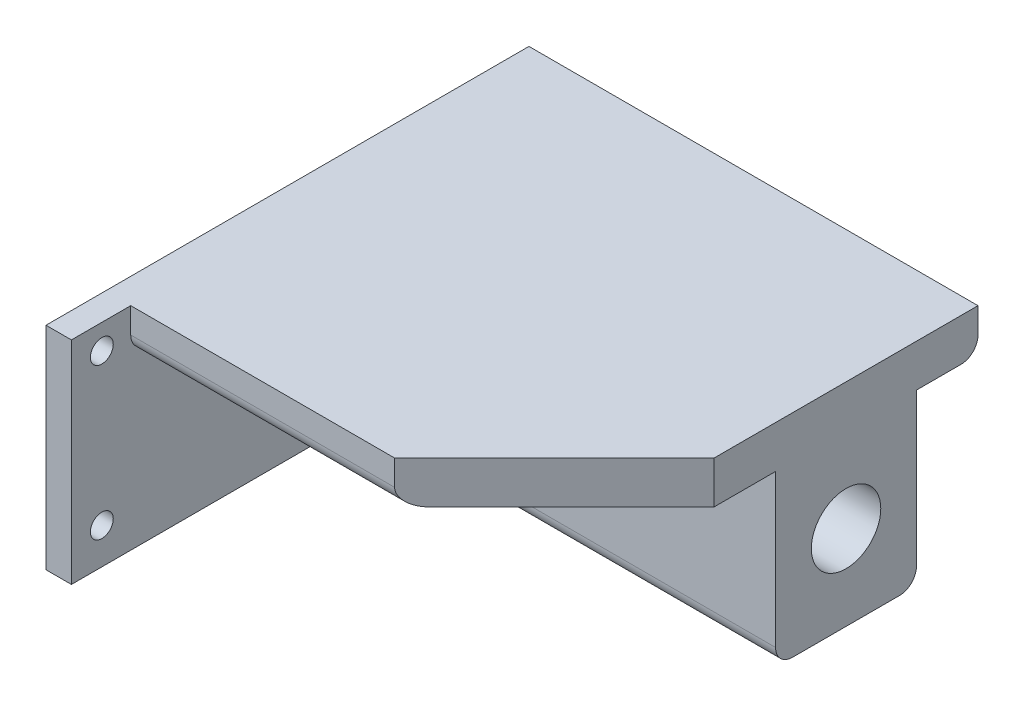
from build123d import *

# Parameters (mm, degrees)
BOSS_EXTRUDE1_DEPTH     = 5
SKETCH2_W               = 50
SKETCH2_H               = 16.625226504
BOSS_EXTRUDE2_DEPTH     = 20
SKETCH3_R               = 4.1
CUT_EXTRUDE1_DEPTH      = 30
FILLET1_R               = 2
SKETCH8_W               = 57
SKETCH8_H               = 25
BOSS_EXTRUDE5_DEPTH     = 3
CUT_EXTRUDE2_DEPTH      = 63.960295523
CUT_EXTRUDE2_DEPTH_BACK = 63.960295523
SKETCH9_R               = 1.35


with BuildPart() as part:
    # Sketch1 → Boss-Extrude1 (new body)
    with BuildSketch(Plane(origin=(0, 0, 0), x_dir=(1, 0, 0), z_dir=(0, 1, 0))):
        Polygon((5.529592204, -25.618994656), (24.381005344, -6.767581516), (24.381005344, 24.381005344), (-25.618994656, 24.381005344), (-25.618994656, -25.618994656), align=None)
    extrude(amount=BOSS_EXTRUDE1_DEPTH)

    # Sketch2 → Boss-Extrude2 (add)
    with BuildSketch(Plane.XZ):
        with Locations((-0.618994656, -8.806711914)):
            Rectangle(SKETCH2_W, SKETCH2_H)
    extrude(amount=BOSS_EXTRUDE2_DEPTH)

    # Sketch3 → Cut-Extrude1 (cut)
    with BuildSketch(Plane(origin=(24.381005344, 0, 0), x_dir=(0, 0, -1), z_dir=(1, 0, 0))):
        with Locations((8.806711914, -10)):
            Circle(SKETCH3_R)
    extrude(amount=-CUT_EXTRUDE1_DEPTH, mode=Mode.SUBTRACT)

    # Fillet1
    fillet1_edges = [part.edges().sort_by_distance(p)[0] for p in [
        (-0.618994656, -20, -0.494098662),
        (-0.618994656, -20, -17.119325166),
        (-10.044701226, 0, 25.618994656),
        (-0.618994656, 0, -24.381005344),
    ]]
    fillet(fillet1_edges, radius=FILLET1_R)

    # Sketch8 → Boss-Extrude5 (add)
    with BuildSketch(Plane.ZY.offset(25.618994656)):
        with Locations((4.118994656, -7.5)):
            Rectangle(SKETCH8_W, SKETCH8_H)
    extrude(amount=BOSS_EXTRUDE5_DEPTH)

    # Sketch9 → Cut-Extrude2 (cut, two sides: drawn at the far end of the back side and taken through both)
    with BuildSketch(Plane(origin=(-25.618994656, 0, 0), x_dir=(0, 0, -1), z_dir=(1, 0, 0)).offset(-CUT_EXTRUDE2_DEPTH_BACK)):
        with Locations((21.116776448, -3.149002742)):
            Circle(SKETCH9_R)
        with Locations((21.116776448, -15.749800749)):
            Circle(SKETCH9_R)
        with Locations((-29.029851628, -15.749800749)):
            Circle(SKETCH9_R)
        with Locations((-29.029851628, 2.091741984)):
            Circle(SKETCH9_R)
    extrude(amount=CUT_EXTRUDE2_DEPTH + CUT_EXTRUDE2_DEPTH_BACK, mode=Mode.SUBTRACT)


solid = part.part
